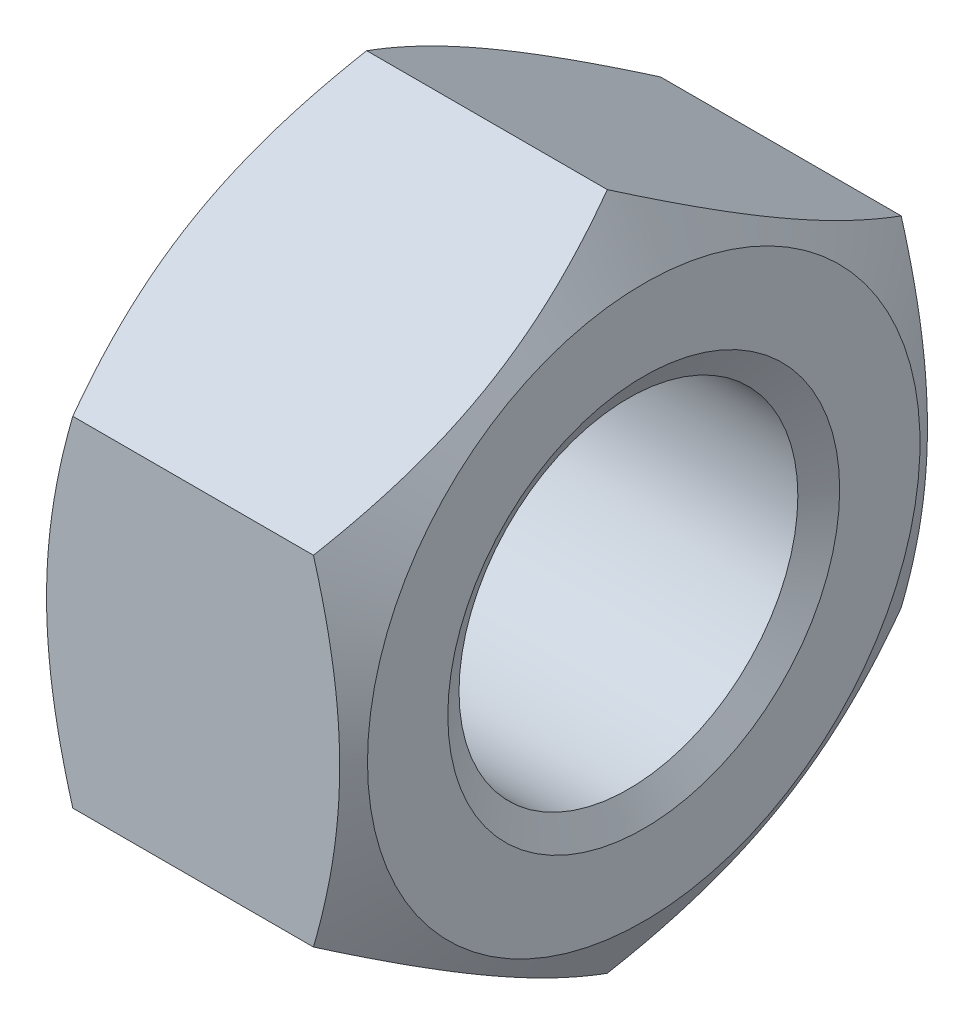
ISO-10303-21;
HEADER;
FILE_DESCRIPTION(('STEP AP214'),'2;1');
FILE_NAME('part.step','',(''),(''),'','','');
FILE_SCHEMA(('AUTOMOTIVE_DESIGN { 1 0 10303 214 1 1 1 1 }'));
ENDSEC;
DATA;
#1=APPLICATION_CONTEXT('core data for automotive mechanical design processes');
#2=APPLICATION_PROTOCOL_DEFINITION('international standard','automotive_design',2000,#1);
#3=PRODUCT_CONTEXT('',#1,'mechanical');
#4=PRODUCT('Part','Part','',(#3));
#5=PRODUCT_RELATED_PRODUCT_CATEGORY('part','',(#4));
#6=PRODUCT_DEFINITION_FORMATION('','',#4);
#7=PRODUCT_DEFINITION_CONTEXT('part definition',#1,'design');
#8=PRODUCT_DEFINITION('design','',#6,#7);
#9=PRODUCT_DEFINITION_SHAPE('','',#8);
#10=(LENGTH_UNIT() NAMED_UNIT(*) SI_UNIT(.MILLI.,.METRE.));
#11=(NAMED_UNIT(*) PLANE_ANGLE_UNIT() SI_UNIT($,.RADIAN.));
#12=(NAMED_UNIT(*) SI_UNIT($,.STERADIAN.) SOLID_ANGLE_UNIT());
#13=UNCERTAINTY_MEASURE_WITH_UNIT(LENGTH_MEASURE(1.E-05),#10,'distance_accuracy_value','');
#14=(GEOMETRIC_REPRESENTATION_CONTEXT(3) GLOBAL_UNCERTAINTY_ASSIGNED_CONTEXT((#13)) GLOBAL_UNIT_ASSIGNED_CONTEXT((#10,
#11,#12)) REPRESENTATION_CONTEXT('',''));
#15=CARTESIAN_POINT('',(0.,0.,0.));
#16=DIRECTION('',(0.,0.,1.));
#17=DIRECTION('',(1.,0.,0.));
#18=AXIS2_PLACEMENT_3D('',#15,#16,#17);
#19=CARTESIAN_POINT('',(0.,-8.66025403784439,15.));
#20=DIRECTION('',(0.,0.,1.));
#21=DIRECTION('',(1.,0.,0.));
#22=AXIS2_PLACEMENT_3D('',#19,#20,#21);
#23=PLANE('',#22);
#24=CARTESIAN_POINT('',(14.1406387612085,8.66025406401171,14.999999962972));
#25=CARTESIAN_POINT('',(14.2505268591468,8.27955805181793,14.9999999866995));
#26=CARTESIAN_POINT('',(14.3554282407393,7.89737711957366,14.9999999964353));
#27=CARTESIAN_POINT('',(14.5538714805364,7.12995063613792,15.0000000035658));
#28=CARTESIAN_POINT('',(14.6474096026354,6.74470412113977,15.0000000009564));
#29=CARTESIAN_POINT('',(14.8218689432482,5.97040202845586,14.9999999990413));
#30=CARTESIAN_POINT('',(14.9027603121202,5.58133967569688,14.9999999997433));
#31=CARTESIAN_POINT('',(15.0501891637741,4.80051152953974,15.0000000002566));
#32=CARTESIAN_POINT('',(15.1167274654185,4.40874589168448,15.000000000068));
#33=CARTESIAN_POINT('',(15.2326201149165,3.63254947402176,14.9999999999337));
#34=CARTESIAN_POINT('',(15.2823580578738,3.24817631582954,14.9999999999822));
#35=CARTESIAN_POINT('',(15.3657566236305,2.47766883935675,15.0000000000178));
#36=CARTESIAN_POINT('',(15.3994169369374,2.09153448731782,15.0000000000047));
#37=CARTESIAN_POINT('',(15.4498103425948,1.3186172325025,14.9999999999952));
#38=CARTESIAN_POINT('',(15.4665635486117,0.931835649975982,14.9999999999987));
#39=CARTESIAN_POINT('',(15.482782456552,0.157915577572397,15.0000000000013));
#40=CARTESIAN_POINT('',(15.4822486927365,-0.22922290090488,15.0000000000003));
#41=CARTESIAN_POINT('',(15.4651019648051,-0.952960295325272,14.9999999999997));
#42=CARTESIAN_POINT('',(15.450580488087,-1.28961081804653,14.9999999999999));
#43=CARTESIAN_POINT('',(15.4087390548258,-1.96213746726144,15.0000000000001));
#44=CARTESIAN_POINT('',(15.3814181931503,-2.29801353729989,15.));
#45=CARTESIAN_POINT('',(15.314454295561,-2.96880885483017,15.));
#46=CARTESIAN_POINT('',(15.2748010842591,-3.30372708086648,15.));
#47=CARTESIAN_POINT('',(15.1838681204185,-3.97199344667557,15.));
#48=CARTESIAN_POINT('',(15.1325875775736,-4.30534147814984,15.));
#49=CARTESIAN_POINT('',(14.9600087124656,-5.3172370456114,15.));
#50=CARTESIAN_POINT('',(14.8215033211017,-5.99285447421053,15.));
#51=CARTESIAN_POINT('',(14.5071537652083,-7.33401574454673,15.));
#52=CARTESIAN_POINT('',(14.3313834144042,-7.99957675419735,15.));
#53=CARTESIAN_POINT('',(14.1406388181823,-8.66025395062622,15.));
#54=B_SPLINE_CURVE_WITH_KNOTS('',3,(#24,#25,#26,#27,#28,#29,#30,#31,#32,#33,#34,#35,#36,#37,#38,
#39,#40,#41,#42,#43,#44,#45,#46,#47,#48,#49,#50,#51,#52,#53),.UNSPECIFIED.,.F.,.F.,(4,2,2,2,2,2,
2,2,2,2,2,2,2,2,4),(0.,1.18874621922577,2.37788223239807,3.56978387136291,4.76161749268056,
5.9240346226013,7.0864741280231,8.24752909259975,9.40854817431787,10.4191952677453,
11.4299138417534,12.4414685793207,13.4530920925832,15.5208227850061,17.584495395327),.UNSPECIFIED.);
#55=CARTESIAN_POINT('',(14.1406388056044,8.66025405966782,14.9999999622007));
#56=VERTEX_POINT('',#55);
#57=CARTESIAN_POINT('',(14.1406388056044,-8.66025399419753,15.));
#58=VERTEX_POINT('',#57);
#59=EDGE_CURVE('E91',#56,#58,#54,.T.);
#60=ORIENTED_EDGE('',*,*,#59,.F.);
#61=DIRECTION('',(1.,0.,0.));
#62=VECTOR('',#61,1.);
#63=CARTESIAN_POINT('',(0.,8.66025403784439,15.));
#64=LINE('',#63,#62);
#65=CARTESIAN_POINT('',(1.85936119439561,8.66025399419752,15.));
#66=VERTEX_POINT('',#65);
#67=EDGE_CURVE('E79',#66,#56,#64,.T.);
#68=ORIENTED_EDGE('',*,*,#67,.F.);
#69=CARTESIAN_POINT('',(1.85936118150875,-8.66025395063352,15.000000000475));
#70=CARTESIAN_POINT('',(1.74947309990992,-8.27955793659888,15.0000000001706));
#71=CARTESIAN_POINT('',(1.64457172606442,-7.89737700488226,15.0000000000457));
#72=CARTESIAN_POINT('',(1.44612849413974,-7.12995052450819,14.9999999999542));
#73=CARTESIAN_POINT('',(1.35259037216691,-6.74470401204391,14.9999999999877));
#74=CARTESIAN_POINT('',(1.17813103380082,-5.97040192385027,15.0000000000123));
#75=CARTESIAN_POINT('',(1.09723966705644,-5.58133957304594,15.0000000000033));
#76=CARTESIAN_POINT('',(0.949810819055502,-4.80051143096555,14.9999999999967));
#77=CARTESIAN_POINT('',(0.883272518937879,-4.4087457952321,14.9999999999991));
#78=CARTESIAN_POINT('',(0.767379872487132,-3.63254938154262,15.0000000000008));
#79=CARTESIAN_POINT('',(0.717641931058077,-3.24817622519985,15.0000000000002));
#80=CARTESIAN_POINT('',(0.634243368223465,-2.4776687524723,14.9999999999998));
#81=CARTESIAN_POINT('',(0.600583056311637,-2.09153440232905,14.9999999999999));
#82=CARTESIAN_POINT('',(0.550189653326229,-1.31861715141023,15.0000000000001));
#83=CARTESIAN_POINT('',(0.533436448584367,-0.931835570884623,15.));
#84=CARTESIAN_POINT('',(0.517217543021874,-0.157915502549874,15.));
#85=CARTESIAN_POINT('',(0.517751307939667,0.229222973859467,15.));
#86=CARTESIAN_POINT('',(0.534898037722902,0.952960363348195,15.));
#87=CARTESIAN_POINT('',(0.549419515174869,1.28961088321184,15.));
#88=CARTESIAN_POINT('',(0.591260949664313,1.96213752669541,15.));
#89=CARTESIAN_POINT('',(0.618581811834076,2.29801359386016,15.));
#90=CARTESIAN_POINT('',(0.685545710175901,2.96880890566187,15.));
#91=CARTESIAN_POINT('',(0.725198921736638,3.30372712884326,15.));
#92=CARTESIAN_POINT('',(0.816131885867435,3.97199348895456,15.));
#93=CARTESIAN_POINT('',(0.867412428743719,4.30534151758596,15.));
#94=CARTESIAN_POINT('',(1.03999129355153,5.31723707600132,15.));
#95=CARTESIAN_POINT('',(1.17849668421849,5.99285449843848,15.));
#96=CARTESIAN_POINT('',(1.49284623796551,7.33401575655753,15.));
#97=CARTESIAN_POINT('',(1.66861658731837,7.99957676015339,15.));
#98=CARTESIAN_POINT('',(1.85936118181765,8.66025395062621,15.));
#99=B_SPLINE_CURVE_WITH_KNOTS('',3,(#69,#70,#71,#72,#73,#74,#75,#76,#77,#78,#79,#80,#81,#82,#83,
#84,#85,#86,#87,#88,#89,#90,#91,#92,#93,#94,#95,#96,#97,#98),.UNSPECIFIED.,.F.,.F.,(4,2,2,2,2,2,
2,2,2,2,2,2,2,2,4),(0.,1.18874621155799,2.37788221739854,3.56978384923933,4.76161746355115,
5.92403458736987,7.08647408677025,8.24752904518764,9.40854812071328,10.4191952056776,
11.4299137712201,12.4414685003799,13.453092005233,15.5208226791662,17.5844952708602),.UNSPECIFIED.);
#100=CARTESIAN_POINT('',(1.8593612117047,-8.66025402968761,15.000000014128));
#101=VERTEX_POINT('',#100);
#102=EDGE_CURVE('E115',#101,#66,#99,.T.);
#103=ORIENTED_EDGE('',*,*,#102,.F.);
#104=DIRECTION('',(1.,0.,0.));
#105=VECTOR('',#104,1.);
#106=CARTESIAN_POINT('',(0.,-8.66025403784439,15.));
#107=LINE('',#106,#105);
#108=EDGE_CURVE('E94',#58,#101,#107,.F.);
#109=ORIENTED_EDGE('',*,*,#108,.F.);
#110=EDGE_LOOP('',(#60,#68,#103,#109));
#111=FACE_BOUND('',#110,.T.);
#112=ADVANCED_FACE('F15',(#111),#23,.T.);
#113=CARTESIAN_POINT('',(0.,8.66025403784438,15.));
#114=DIRECTION('',(0.,0.866025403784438,0.5));
#115=DIRECTION('',(0.,-0.5,0.866025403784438));
#116=AXIS2_PLACEMENT_3D('',#113,#114,#115);
#117=PLANE('',#116);
#118=CARTESIAN_POINT('',(14.1406388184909,17.3205080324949,7.57635507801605E-08));
#119=CARTESIAN_POINT('',(14.2505269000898,17.1301600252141,0.32969249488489));
#120=CARTESIAN_POINT('',(14.3554282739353,16.9390695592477,0.66067089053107));
#121=CARTESIAN_POINT('',(14.5538715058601,16.5553563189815,1.3252817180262));
#122=CARTESIAN_POINT('',(14.6474096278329,16.3627330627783,1.65891498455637));
#123=CARTESIAN_POINT('',(14.821868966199,15.9755820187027,2.32948026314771));
#124=CARTESIAN_POINT('',(14.9027603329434,15.7810508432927,2.66641814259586));
#125=CARTESIAN_POINT('',(15.0501891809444,15.3906367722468,3.34263514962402));
#126=CARTESIAN_POINT('',(15.116727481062,15.1947539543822,3.68191414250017));
#127=CARTESIAN_POINT('',(15.2326201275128,14.8066557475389,4.35411995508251));
#128=CARTESIAN_POINT('',(15.2823580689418,14.614469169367,4.68699687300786));
#129=CARTESIAN_POINT('',(15.3657566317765,14.2292154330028,5.35427591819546));
#130=CARTESIAN_POINT('',(15.3994169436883,14.0361482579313,5.68867807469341));
#131=CARTESIAN_POINT('',(15.4498103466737,13.649689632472,6.35804404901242));
#132=CARTESIAN_POINT('',(15.4665635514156,13.4562988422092,6.69300672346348));
#133=CARTESIAN_POINT('',(15.4827824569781,13.0693388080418,7.36324116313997));
#134=CARTESIAN_POINT('',(15.4822486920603,12.8757695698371,7.69851291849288));
#135=CARTESIAN_POINT('',(15.4651019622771,12.5139008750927,8.32528788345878));
#136=CARTESIAN_POINT('',(15.4505804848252,12.3455756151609,8.61683578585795));
#137=CARTESIAN_POINT('',(15.4087390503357,12.0093122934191,9.19926094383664));
#138=CARTESIAN_POINT('',(15.381418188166,11.8413742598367,9.49013815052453));
#139=CARTESIAN_POINT('',(15.3144542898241,11.5059766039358,10.0710639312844));
#140=CARTESIAN_POINT('',(15.2748010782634,11.3385174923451,10.3611116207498));
#141=CARTESIAN_POINT('',(15.1838681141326,11.0043843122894,10.9398472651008));
#142=CARTESIAN_POINT('',(15.1325875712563,10.8377102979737,11.2285351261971));
#143=CARTESIAN_POINT('',(14.9600087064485,10.331762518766,12.1048623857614));
#144=CARTESIAN_POINT('',(14.8215033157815,9.99395380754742,12.6899642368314));
#145=CARTESIAN_POINT('',(14.5071537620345,9.32337317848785,13.8514439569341));
#146=CARTESIAN_POINT('',(14.3313834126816,8.9905926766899,14.4278366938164));
#147=CARTESIAN_POINT('',(14.1406388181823,8.66025408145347,14.9999999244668));
#148=B_SPLINE_CURVE_WITH_KNOTS('',3,(#118,#119,#120,#121,#122,#123,#124,#125,#126,#127,#128,
#129,#130,#131,#132,#133,#134,#135,#136,#137,#138,#139,#140,#141,#142,#143,#144,#145,#146,#147),
.UNSPECIFIED.,.F.,.F.,(4,2,2,2,2,2,2,2,2,2,2,2,2,2,4),(0.,1.18874621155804,2.37788221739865,
3.56978384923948,4.76161746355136,5.92403458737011,7.08647408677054,8.24752904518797,
9.40854812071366,10.419195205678,11.4299137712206,12.4414685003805,13.4530920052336,
15.5208226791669,17.584495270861),.UNSPECIFIED.);
#149=CARTESIAN_POINT('',(14.1406387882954,17.3205080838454,1.41276080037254E-08));
#150=VERTEX_POINT('',#149);
#151=EDGE_CURVE('E19',#150,#56,#148,.T.);
#152=ORIENTED_EDGE('',*,*,#151,.F.);
#153=DIRECTION('',(1.,0.,0.));
#154=VECTOR('',#153,1.);
#155=CARTESIAN_POINT('',(0.,17.3205080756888,0.));
#156=LINE('',#155,#154);
#157=CARTESIAN_POINT('',(1.85936119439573,17.3205080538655,3.77989384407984E-08));
#158=VERTEX_POINT('',#157);
#159=EDGE_CURVE('E72',#158,#150,#156,.T.);
#160=ORIENTED_EDGE('',*,*,#159,.F.);
#161=CARTESIAN_POINT('',(1.85936123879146,8.66025399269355,15.0000000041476));
#162=CARTESIAN_POINT('',(1.74947314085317,8.85060201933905,14.6703075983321));
#163=CARTESIAN_POINT('',(1.64457175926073,9.04169249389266,14.3393292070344));
#164=CARTESIAN_POINT('',(1.44612851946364,9.42540574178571,13.6747183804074));
#165=CARTESIAN_POINT('',(1.3525903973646,9.61802899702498,13.3410851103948));
#166=CARTESIAN_POINT('',(1.1781310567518,10.0051800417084,12.6705198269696));
#167=CARTESIAN_POINT('',(1.09723968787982,10.1997112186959,12.3335819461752));
#168=CARTESIAN_POINT('',(0.949810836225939,10.590125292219,11.6573649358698));
#169=CARTESIAN_POINT('',(0.883272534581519,10.7860081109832,11.318085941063));
#170=CARTESIAN_POINT('',(0.767379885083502,11.1741063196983,10.6458801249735));
#171=CARTESIAN_POINT('',(0.717641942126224,11.3662928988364,10.3130032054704));
#172=CARTESIAN_POINT('',(0.634243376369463,11.7515466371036,9.64572415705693));
#173=CARTESIAN_POINT('',(0.600583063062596,11.9446138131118,9.31132199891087));
#174=CARTESIAN_POINT('',(0.550189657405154,12.3310724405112,8.64195602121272));
#175=CARTESIAN_POINT('',(0.53343645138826,12.5244632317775,8.30699334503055));
#176=CARTESIAN_POINT('',(0.51721754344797,12.9114232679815,7.63675890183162));
#177=CARTESIAN_POINT('',(0.517751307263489,13.1049925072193,7.30148714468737));
#178=CARTESIAN_POINT('',(0.534898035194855,13.466861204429,6.67471217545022));
#179=CARTESIAN_POINT('',(0.549419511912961,13.6351864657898,6.38316427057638));
#180=CARTESIAN_POINT('',(0.591260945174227,13.9714497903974,5.80073910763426));
#181=CARTESIAN_POINT('',(0.61858180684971,14.1393878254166,5.50986189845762));
#182=CARTESIAN_POINT('',(0.685545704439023,14.4747854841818,4.92893611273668));
#183=CARTESIAN_POINT('',(0.725198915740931,14.6422445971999,4.63888842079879));
#184=CARTESIAN_POINT('',(0.816131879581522,14.9763777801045,4.06015277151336));
#185=CARTESIAN_POINT('',(0.867412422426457,15.1430517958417,3.77146490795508));
#186=CARTESIAN_POINT('',(1.03999128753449,15.6489995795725,2.89513764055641));
#187=CARTESIAN_POINT('',(1.1784966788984,15.9868082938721,2.31003578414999));
#188=CARTESIAN_POINT('',(1.49284623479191,16.6573889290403,1.14855605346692));
#189=CARTESIAN_POINT('',(1.66861658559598,16.9901694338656,0.572163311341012));
#190=CARTESIAN_POINT('',(1.85936118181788,17.3205080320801,7.55324771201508E-08));
#191=B_SPLINE_CURVE_WITH_KNOTS('',3,(#161,#162,#163,#164,#165,#166,#167,#168,#169,#170,#171,
#172,#173,#174,#175,#176,#177,#178,#179,#180,#181,#182,#183,#184,#185,#186,#187,#188,#189,#190),
.UNSPECIFIED.,.F.,.F.,(4,2,2,2,2,2,2,2,2,2,2,2,2,2,4),(0.,1.18874621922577,2.37788223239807,
3.56978387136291,4.76161749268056,5.9240346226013,7.0864741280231,8.24752909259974,
9.40854817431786,10.4191952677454,11.4299138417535,12.441468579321,13.4530920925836,
15.5208227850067,17.5844953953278),.UNSPECIFIED.);
#192=EDGE_CURVE('E82',#66,#158,#191,.T.);
#193=ORIENTED_EDGE('',*,*,#192,.F.);
#194=ORIENTED_EDGE('',*,*,#67,.T.);
#195=EDGE_LOOP('',(#152,#160,#193,#194));
#196=FACE_BOUND('',#195,.T.);
#197=ADVANCED_FACE('F81',(#196),#117,.T.);
#198=CARTESIAN_POINT('',(0.,17.3205080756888,0.));
#199=DIRECTION('',(0.,0.866025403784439,-0.499999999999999));
#200=DIRECTION('',(0.,0.499999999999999,0.866025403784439));
#201=AXIS2_PLACEMENT_3D('',#198,#199,#200);
#202=PLANE('',#201);
#203=CARTESIAN_POINT('',(14.1406387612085,8.66025399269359,-15.0000000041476));
#204=CARTESIAN_POINT('',(14.2505268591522,8.85060201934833,-14.6703075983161));
#205=CARTESIAN_POINT('',(14.3554282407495,9.04169249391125,-14.3393292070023));
#206=CARTESIAN_POINT('',(14.5538714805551,9.42540574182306,-13.6747183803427));
#207=CARTESIAN_POINT('',(14.6474096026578,9.61802899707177,-13.3410851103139));
#208=CARTESIAN_POINT('',(14.8218689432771,10.0051800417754,-12.6705198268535));
#209=CARTESIAN_POINT('',(14.9027603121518,10.1997112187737,-12.3335819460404));
#210=CARTESIAN_POINT('',(15.0501891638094,10.5901252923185,-11.6573649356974));
#211=CARTESIAN_POINT('',(15.1167274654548,10.7860081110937,-11.3180859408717));
#212=CARTESIAN_POINT('',(15.2326201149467,11.1741063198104,-10.6458801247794));
#213=CARTESIAN_POINT('',(15.2823580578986,11.366292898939,-10.3130032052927));
#214=CARTESIAN_POINT('',(15.365756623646,11.751546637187,-9.64572415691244));
#215=CARTESIAN_POINT('',(15.3994169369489,11.9446138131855,-9.31132199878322));
#216=CARTESIAN_POINT('',(15.4498103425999,12.3310724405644,-8.64195602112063));
#217=CARTESIAN_POINT('',(15.4665635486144,12.5244632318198,-8.30699334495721));
#218=CARTESIAN_POINT('',(15.482782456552,12.9114232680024,-7.63675890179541));
#219=CARTESIAN_POINT('',(15.4822486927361,13.1049925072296,-7.30148714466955));
#220=CARTESIAN_POINT('',(15.465101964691,13.466861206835,-6.67471217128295));
#221=CARTESIAN_POINT('',(15.4505804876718,13.6351864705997,-6.38316426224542));
#222=CARTESIAN_POINT('',(15.4087390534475,13.9714498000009,-5.80073909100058));
#223=CARTESIAN_POINT('',(15.3814181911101,14.1393878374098,-5.50986187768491));
#224=CARTESIAN_POINT('',(15.3144542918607,14.4747855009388,-4.9289360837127));
#225=CARTESIAN_POINT('',(15.2748010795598,14.6422446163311,-4.63888838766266));
#226=CARTESIAN_POINT('',(15.1838681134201,14.976377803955,-4.06015273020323));
#227=CARTESIAN_POINT('',(15.1325875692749,15.1430518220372,-3.77146486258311));
#228=CARTESIAN_POINT('',(14.9600086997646,15.6489996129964,-2.89513758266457));
#229=CARTESIAN_POINT('',(14.8215033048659,15.9868083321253,-2.31003571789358));
#230=CARTESIAN_POINT('',(14.5071537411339,16.6573889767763,-1.14855597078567));
#231=CARTESIAN_POINT('',(14.331383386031,16.9901694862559,-0.572163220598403));
#232=CARTESIAN_POINT('',(14.1406387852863,17.3205080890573,2.31549808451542E-08));
#233=B_SPLINE_CURVE_WITH_KNOTS('',3,(#203,#204,#205,#206,#207,#208,#209,#210,#211,#212,#213,
#214,#215,#216,#217,#218,#219,#220,#221,#222,#223,#224,#225,#226,#227,#228,#229,#230,#231,#232),
.UNSPECIFIED.,.F.,.F.,(4,2,2,2,2,2,2,2,2,2,2,2,2,2,4),(0.,1.18874621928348,2.3778822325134,
3.56978387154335,4.76161749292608,5.92403462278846,7.08647412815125,8.24752909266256,
9.40854817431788,10.4191952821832,11.4299138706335,12.441468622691,13.4530921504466,
15.5208228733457,17.5844955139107),.UNSPECIFIED.);
#234=CARTESIAN_POINT('',(14.1406388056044,8.66025399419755,-15.));
#235=VERTEX_POINT('',#234);
#236=EDGE_CURVE('E93',#235,#150,#233,.T.);
#237=ORIENTED_EDGE('',*,*,#236,.F.);
#238=DIRECTION('',(-1.,0.,0.));
#239=VECTOR('',#238,1.);
#240=CARTESIAN_POINT('',(0.,8.66025403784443,-15.));
#241=LINE('',#240,#239);
#242=CARTESIAN_POINT('',(1.85936119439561,8.66025405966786,-14.9999999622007));
#243=VERTEX_POINT('',#242);
#244=EDGE_CURVE('E188',#243,#235,#241,.F.);
#245=ORIENTED_EDGE('',*,*,#244,.F.);
#246=CARTESIAN_POINT('',(1.85936123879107,17.3205080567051,4.1174744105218E-08));
#247=CARTESIAN_POINT('',(1.7494731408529,17.1301600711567,-0.32969238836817));
#248=CARTESIAN_POINT('',(1.6445717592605,16.9390696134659,-0.660670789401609));
#249=CARTESIAN_POINT('',(1.44612851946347,16.5553563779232,-1.32528162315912));
#250=CARTESIAN_POINT('',(1.35259039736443,16.3627331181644,-1.65891489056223));
#251=CARTESIAN_POINT('',(1.17813105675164,15.9755820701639,-2.32948017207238));
#252=CARTESIAN_POINT('',(1.09723968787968,15.7810508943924,-2.6664180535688));
#253=CARTESIAN_POINT('',(0.949810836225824,15.3906368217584,-3.34263506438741));
#254=CARTESIAN_POINT('',(0.883272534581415,15.1947540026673,-3.68191405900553));
#255=CARTESIAN_POINT('',(0.76737988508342,14.8066557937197,-4.35411987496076));
#256=CARTESIAN_POINT('',(0.717641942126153,14.6144692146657,-4.68699679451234));
#257=CARTESIAN_POINT('',(0.634243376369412,14.22921547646,-5.35427584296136));
#258=CARTESIAN_POINT('',(0.600583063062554,14.0361483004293,-5.68867800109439));
#259=CARTESIAN_POINT('',(0.550189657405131,13.6496896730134,-6.35804397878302));
#260=CARTESIAN_POINT('',(0.533436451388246,13.4562988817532,-6.69300665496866));
#261=CARTESIAN_POINT('',(0.517217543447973,13.0693388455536,-7.3632410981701));
#262=CARTESIAN_POINT('',(0.5177513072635,12.8757696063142,-7.69851285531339));
#263=CARTESIAN_POINT('',(0.534898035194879,12.5139009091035,-8.32528782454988));
#264=CARTESIAN_POINT('',(0.549419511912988,12.345575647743,-8.61683572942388));
#265=CARTESIAN_POINT('',(0.591260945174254,12.0093123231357,-9.19926089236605));
#266=CARTESIAN_POINT('',(0.618581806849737,11.8413742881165,-9.49013810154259));
#267=CARTESIAN_POINT('',(0.685545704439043,11.5059766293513,-10.0710638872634));
#268=CARTESIAN_POINT('',(0.725198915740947,11.3385175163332,-10.3611115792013));
#269=CARTESIAN_POINT('',(0.816131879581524,11.0043843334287,-10.9398472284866));
#270=CARTESIAN_POINT('',(0.86741242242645,10.8377103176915,-11.2285350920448));
#271=CARTESIAN_POINT('',(1.03999128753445,10.3317625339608,-12.1048623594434));
#272=CARTESIAN_POINT('',(1.17849667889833,9.99395381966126,-12.6899642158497));
#273=CARTESIAN_POINT('',(1.49284623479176,9.32337318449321,-13.8514439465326));
#274=CARTESIAN_POINT('',(1.6686165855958,8.99059267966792,-14.4278366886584));
#275=CARTESIAN_POINT('',(1.85936118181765,8.66025408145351,-14.9999999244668));
#276=B_SPLINE_CURVE_WITH_KNOTS('',3,(#246,#247,#248,#249,#250,#251,#252,#253,#254,#255,#256,
#257,#258,#259,#260,#261,#262,#263,#264,#265,#266,#267,#268,#269,#270,#271,#272,#273,#274,#275),
.UNSPECIFIED.,.F.,.F.,(4,2,2,2,2,2,2,2,2,2,2,2,2,2,4),(0.,1.18874621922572,2.37788223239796,
3.56978387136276,4.76161749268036,5.92403462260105,7.08647412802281,8.24752909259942,
9.4085481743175,10.4191952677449,11.4299138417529,12.4414685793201,13.4530920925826,
15.5208227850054,17.5844953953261),.UNSPECIFIED.);
#277=EDGE_CURVE('E158',#158,#243,#276,.T.);
#278=ORIENTED_EDGE('',*,*,#277,.F.);
#279=ORIENTED_EDGE('',*,*,#159,.T.);
#280=EDGE_LOOP('',(#237,#245,#278,#279));
#281=FACE_BOUND('',#280,.T.);
#282=ADVANCED_FACE('F162',(#281),#202,.T.);
#283=CARTESIAN_POINT('',(0.,8.66025403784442,-15.));
#284=DIRECTION('',(0.,0.,-1.));
#285=DIRECTION('',(-1.,0.,0.));
#286=AXIS2_PLACEMENT_3D('',#283,#284,#285);
#287=PLANE('',#286);
#288=CARTESIAN_POINT('',(14.1406387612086,-8.66025406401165,-14.999999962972));
#289=CARTESIAN_POINT('',(14.2505268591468,-8.27955805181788,-14.9999999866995));
#290=CARTESIAN_POINT('',(14.3554282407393,-7.8973771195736,-14.9999999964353));
#291=CARTESIAN_POINT('',(14.5538714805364,-7.12995063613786,-15.0000000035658));
#292=CARTESIAN_POINT('',(14.6474096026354,-6.74470412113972,-15.0000000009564));
#293=CARTESIAN_POINT('',(14.8218689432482,-5.97040202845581,-14.9999999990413));
#294=CARTESIAN_POINT('',(14.9027603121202,-5.58133967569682,-14.9999999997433));
#295=CARTESIAN_POINT('',(15.0501891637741,-4.80051152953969,-15.0000000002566));
#296=CARTESIAN_POINT('',(15.1167274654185,-4.40874589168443,-15.000000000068));
#297=CARTESIAN_POINT('',(15.2326201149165,-3.63254947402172,-14.9999999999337));
#298=CARTESIAN_POINT('',(15.2823580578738,-3.24817631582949,-14.9999999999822));
#299=CARTESIAN_POINT('',(15.3657566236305,-2.4776688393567,-15.0000000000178));
#300=CARTESIAN_POINT('',(15.3994169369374,-2.09153448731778,-15.0000000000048));
#301=CARTESIAN_POINT('',(15.4498103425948,-1.31861723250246,-14.9999999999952));
#302=CARTESIAN_POINT('',(15.4665635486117,-0.931835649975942,-14.9999999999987));
#303=CARTESIAN_POINT('',(15.482782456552,-0.157915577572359,-15.0000000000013));
#304=CARTESIAN_POINT('',(15.4822486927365,0.229222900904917,-15.0000000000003));
#305=CARTESIAN_POINT('',(15.4651019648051,0.952960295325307,-14.9999999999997));
#306=CARTESIAN_POINT('',(15.450580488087,1.28961081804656,-14.9999999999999));
#307=CARTESIAN_POINT('',(15.4087390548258,1.96213746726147,-15.0000000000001));
#308=CARTESIAN_POINT('',(15.3814181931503,2.29801353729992,-15.));
#309=CARTESIAN_POINT('',(15.314454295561,2.9688088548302,-15.));
#310=CARTESIAN_POINT('',(15.2748010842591,3.30372708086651,-15.));
#311=CARTESIAN_POINT('',(15.1838681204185,3.9719934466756,-15.));
#312=CARTESIAN_POINT('',(15.1325875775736,4.30534147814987,-15.));
#313=CARTESIAN_POINT('',(14.9600087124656,5.31723704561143,-15.));
#314=CARTESIAN_POINT('',(14.8215033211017,5.99285447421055,-15.));
#315=CARTESIAN_POINT('',(14.5071537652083,7.33401574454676,-15.));
#316=CARTESIAN_POINT('',(14.3313834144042,7.99957675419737,-15.));
#317=CARTESIAN_POINT('',(14.1406388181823,8.66025395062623,-15.));
#318=B_SPLINE_CURVE_WITH_KNOTS('',3,(#288,#289,#290,#291,#292,#293,#294,#295,#296,#297,#298,
#299,#300,#301,#302,#303,#304,#305,#306,#307,#308,#309,#310,#311,#312,#313,#314,#315,#316,#317),
.UNSPECIFIED.,.F.,.F.,(4,2,2,2,2,2,2,2,2,2,2,2,2,2,4),(0.,1.18874621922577,2.37788223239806,
3.5697838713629,4.76161749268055,5.92403462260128,7.08647412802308,8.24752909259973,
9.40854817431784,10.4191952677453,11.4299138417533,12.4414685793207,13.4530920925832,
15.5208227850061,17.584495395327),.UNSPECIFIED.);
#319=CARTESIAN_POINT('',(14.1406388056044,-8.66025405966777,-14.9999999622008));
#320=VERTEX_POINT('',#319);
#321=EDGE_CURVE('E173',#320,#235,#318,.T.);
#322=ORIENTED_EDGE('',*,*,#321,.F.);
#323=DIRECTION('',(1.,0.,0.));
#324=VECTOR('',#323,1.);
#325=CARTESIAN_POINT('',(0.,-8.66025403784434,-15.0000000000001));
#326=LINE('',#325,#324);
#327=CARTESIAN_POINT('',(1.85936119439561,-8.66025399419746,-15.));
#328=VERTEX_POINT('',#327);
#329=EDGE_CURVE('E186',#328,#320,#326,.T.);
#330=ORIENTED_EDGE('',*,*,#329,.F.);
#331=CARTESIAN_POINT('',(1.85936123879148,8.66025406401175,-14.999999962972));
#332=CARTESIAN_POINT('',(1.74947314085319,8.27955805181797,-14.9999999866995));
#333=CARTESIAN_POINT('',(1.64457175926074,7.89737711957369,-14.9999999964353));
#334=CARTESIAN_POINT('',(1.44612851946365,7.12995063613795,-15.0000000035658));
#335=CARTESIAN_POINT('',(1.35259039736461,6.74470412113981,-15.0000000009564));
#336=CARTESIAN_POINT('',(1.17813105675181,5.9704020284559,-14.9999999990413));
#337=CARTESIAN_POINT('',(1.09723968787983,5.58133967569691,-14.9999999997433));
#338=CARTESIAN_POINT('',(0.949810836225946,4.80051152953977,-15.0000000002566));
#339=CARTESIAN_POINT('',(0.883272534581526,4.40874589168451,-15.000000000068));
#340=CARTESIAN_POINT('',(0.767379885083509,3.63254947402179,-14.9999999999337));
#341=CARTESIAN_POINT('',(0.717641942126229,3.24817631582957,-14.9999999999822));
#342=CARTESIAN_POINT('',(0.634243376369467,2.47766883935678,-15.0000000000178));
#343=CARTESIAN_POINT('',(0.600583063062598,2.09153448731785,-15.0000000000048));
#344=CARTESIAN_POINT('',(0.550189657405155,1.31861723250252,-14.9999999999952));
#345=CARTESIAN_POINT('',(0.533436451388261,0.931835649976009,-14.9999999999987));
#346=CARTESIAN_POINT('',(0.517217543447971,0.157915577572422,-15.0000000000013));
#347=CARTESIAN_POINT('',(0.517751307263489,-0.229222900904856,-15.0000000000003));
#348=CARTESIAN_POINT('',(0.534898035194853,-0.952960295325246,-14.9999999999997));
#349=CARTESIAN_POINT('',(0.549419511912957,-1.2896108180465,-14.9999999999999));
#350=CARTESIAN_POINT('',(0.591260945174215,-1.96213746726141,-15.0000000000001));
#351=CARTESIAN_POINT('',(0.618581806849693,-2.29801353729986,-15.));
#352=CARTESIAN_POINT('',(0.685545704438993,-2.96880885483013,-15.));
#353=CARTESIAN_POINT('',(0.725198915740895,-3.30372708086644,-15.));
#354=CARTESIAN_POINT('',(0.816131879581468,-3.97199344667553,-15.));
#355=CARTESIAN_POINT('',(0.867412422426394,-4.3053414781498,-15.));
#356=CARTESIAN_POINT('',(1.0399912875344,-5.31723704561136,-15.));
#357=CARTESIAN_POINT('',(1.17849667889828,-5.99285447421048,-15.));
#358=CARTESIAN_POINT('',(1.49284623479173,-7.33401574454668,-15.));
#359=CARTESIAN_POINT('',(1.66861658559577,-7.99957675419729,-15.));
#360=CARTESIAN_POINT('',(1.85936118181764,-8.66025395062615,-15.));
#361=B_SPLINE_CURVE_WITH_KNOTS('',3,(#331,#332,#333,#334,#335,#336,#337,#338,#339,#340,#341,
#342,#343,#344,#345,#346,#347,#348,#349,#350,#351,#352,#353,#354,#355,#356,#357,#358,#359,#360),
.UNSPECIFIED.,.F.,.F.,(4,2,2,2,2,2,2,2,2,2,2,2,2,2,4),(0.,1.18874621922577,2.37788223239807,
3.56978387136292,4.76161749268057,5.92403462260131,7.08647412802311,8.24752909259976,
9.40854817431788,10.4191952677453,11.4299138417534,12.4414685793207,13.4530920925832,
15.5208227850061,17.584495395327),.UNSPECIFIED.);
#362=EDGE_CURVE('E153',#243,#328,#361,.T.);
#363=ORIENTED_EDGE('',*,*,#362,.F.);
#364=ORIENTED_EDGE('',*,*,#244,.T.);
#365=EDGE_LOOP('',(#322,#330,#363,#364));
#366=FACE_BOUND('',#365,.T.);
#367=ADVANCED_FACE('F165',(#366),#287,.T.);
#368=CARTESIAN_POINT('',(0.,-8.66025403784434,-15.));
#369=DIRECTION('',(0.,-0.866025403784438,-0.500000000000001));
#370=DIRECTION('',(0.,0.500000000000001,-0.866025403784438));
#371=AXIS2_PLACEMENT_3D('',#368,#369,#370);
#372=PLANE('',#371);
#373=CARTESIAN_POINT('',(14.1406387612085,-17.3205080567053,4.11755473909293E-08));
#374=CARTESIAN_POINT('',(14.2505268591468,-17.130160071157,-0.329692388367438));
#375=CARTESIAN_POINT('',(14.3554282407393,-16.9390696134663,-0.660670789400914));
#376=CARTESIAN_POINT('',(14.5538714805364,-16.5553563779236,-1.32528162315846));
#377=CARTESIAN_POINT('',(14.6474096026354,-16.3627331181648,-1.65891489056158));
#378=CARTESIAN_POINT('',(14.8218689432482,-15.9755820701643,-2.32948017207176));
#379=CARTESIAN_POINT('',(14.9027603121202,-15.7810508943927,-2.66641805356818));
#380=CARTESIAN_POINT('',(15.0501891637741,-15.3906368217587,-3.34263506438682));
#381=CARTESIAN_POINT('',(15.1167274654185,-15.1947540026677,-3.68191405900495));
#382=CARTESIAN_POINT('',(15.2326201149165,-14.8066557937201,-4.35411987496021));
#383=CARTESIAN_POINT('',(15.2823580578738,-14.614469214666,-4.6869967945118));
#384=CARTESIAN_POINT('',(15.3657566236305,-14.2292154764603,-5.35427584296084));
#385=CARTESIAN_POINT('',(15.3994169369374,-14.0361483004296,-5.68867800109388));
#386=CARTESIAN_POINT('',(15.4498103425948,-13.6496896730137,-6.35804397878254));
#387=CARTESIAN_POINT('',(15.4665635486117,-13.4562988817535,-6.69300665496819));
#388=CARTESIAN_POINT('',(15.482782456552,-13.0693388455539,-7.36324109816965));
#389=CARTESIAN_POINT('',(15.4822486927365,-12.8757696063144,-7.69851285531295));
#390=CARTESIAN_POINT('',(15.4651019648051,-12.5139009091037,-8.32528782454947));
#391=CARTESIAN_POINT('',(15.450580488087,-12.3455756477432,-8.61683572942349));
#392=CARTESIAN_POINT('',(15.4087390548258,-12.0093123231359,-9.19926089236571));
#393=CARTESIAN_POINT('',(15.3814181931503,-11.8413742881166,-9.49013810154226));
#394=CARTESIAN_POINT('',(15.314454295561,-11.5059766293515,-10.0710638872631));
#395=CARTESIAN_POINT('',(15.2748010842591,-11.3385175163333,-10.361111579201));
#396=CARTESIAN_POINT('',(15.1838681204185,-11.0043843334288,-10.9398472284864));
#397=CARTESIAN_POINT('',(15.1325875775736,-10.8377103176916,-11.2285350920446));
#398=CARTESIAN_POINT('',(14.9600087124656,-10.3317625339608,-12.1048623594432));
#399=CARTESIAN_POINT('',(14.8215033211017,-9.99395381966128,-12.6899642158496));
#400=CARTESIAN_POINT('',(14.5071537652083,-9.32337318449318,-13.8514439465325));
#401=CARTESIAN_POINT('',(14.3313834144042,-8.99059267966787,-14.4278366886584));
#402=CARTESIAN_POINT('',(14.1406388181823,-8.66025408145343,-14.9999999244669));
#403=B_SPLINE_CURVE_WITH_KNOTS('',3,(#373,#374,#375,#376,#377,#378,#379,#380,#381,#382,#383,
#384,#385,#386,#387,#388,#389,#390,#391,#392,#393,#394,#395,#396,#397,#398,#399,#400,#401,#402),
.UNSPECIFIED.,.F.,.F.,(4,2,2,2,2,2,2,2,2,2,2,2,2,2,4),(0.,1.18874621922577,2.37788223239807,
3.56978387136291,4.76161749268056,5.9240346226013,7.0864741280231,8.24752909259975,
9.40854817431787,10.4191952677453,11.4299138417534,12.4414685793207,13.4530920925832,
15.5208227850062,17.584495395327),.UNSPECIFIED.);
#404=CARTESIAN_POINT('',(14.1406388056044,-17.3205080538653,3.77992944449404E-08));
#405=VERTEX_POINT('',#404);
#406=EDGE_CURVE('E97',#405,#320,#403,.T.);
#407=ORIENTED_EDGE('',*,*,#406,.F.);
#408=DIRECTION('',(1.,0.,0.));
#409=VECTOR('',#408,1.);
#410=CARTESIAN_POINT('',(0.,-17.3205080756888,0.));
#411=LINE('',#410,#409);
#412=CARTESIAN_POINT('',(1.85936119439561,-17.3205080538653,-3.77993073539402E-08));
#413=VERTEX_POINT('',#412);
#414=EDGE_CURVE('E190',#413,#405,#411,.T.);
#415=ORIENTED_EDGE('',*,*,#414,.F.);
#416=CARTESIAN_POINT('',(1.85936123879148,-8.66025399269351,-15.0000000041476));
#417=CARTESIAN_POINT('',(1.74947314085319,-8.85060201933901,-14.6703075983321));
#418=CARTESIAN_POINT('',(1.64457175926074,-9.04169249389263,-14.3393292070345));
#419=CARTESIAN_POINT('',(1.44612851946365,-9.42540574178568,-13.6747183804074));
#420=CARTESIAN_POINT('',(1.35259039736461,-9.61802899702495,-13.3410851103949));
#421=CARTESIAN_POINT('',(1.17813105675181,-10.0051800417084,-12.6705198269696));
#422=CARTESIAN_POINT('',(1.09723968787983,-10.1997112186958,-12.3335819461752));
#423=CARTESIAN_POINT('',(0.949810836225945,-10.5901252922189,-11.6573649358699));
#424=CARTESIAN_POINT('',(0.883272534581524,-10.7860081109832,-11.3180859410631));
#425=CARTESIAN_POINT('',(0.767379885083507,-11.1741063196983,-10.6458801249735));
#426=CARTESIAN_POINT('',(0.717641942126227,-11.3662928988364,-10.3130032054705));
#427=CARTESIAN_POINT('',(0.634243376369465,-11.7515466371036,-9.64572415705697));
#428=CARTESIAN_POINT('',(0.600583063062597,-11.9446138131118,-9.31132199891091));
#429=CARTESIAN_POINT('',(0.550189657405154,-12.3310724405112,-8.64195602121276));
#430=CARTESIAN_POINT('',(0.533436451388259,-12.5244632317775,-8.30699334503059));
#431=CARTESIAN_POINT('',(0.517217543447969,-12.9114232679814,-7.63675890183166));
#432=CARTESIAN_POINT('',(0.517751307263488,-13.1049925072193,-7.30148714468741));
#433=CARTESIAN_POINT('',(0.534898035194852,-13.4668612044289,-6.67471217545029));
#434=CARTESIAN_POINT('',(0.549419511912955,-13.6351864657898,-6.38316427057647));
#435=CARTESIAN_POINT('',(0.591260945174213,-13.9714497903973,-5.80073910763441));
#436=CARTESIAN_POINT('',(0.618581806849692,-14.1393878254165,-5.5098618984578));
#437=CARTESIAN_POINT('',(0.685545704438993,-14.4747854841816,-4.92893611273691));
#438=CARTESIAN_POINT('',(0.725198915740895,-14.6422445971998,-4.63888842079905));
#439=CARTESIAN_POINT('',(0.816131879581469,-14.9763777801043,-4.06015277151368));
#440=CARTESIAN_POINT('',(0.867412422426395,-15.1430517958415,-3.77146490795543));
#441=CARTESIAN_POINT('',(1.0399912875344,-15.6489995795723,-2.89513764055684));
#442=CARTESIAN_POINT('',(1.17849667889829,-15.9868082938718,-2.31003578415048));
#443=CARTESIAN_POINT('',(1.49284623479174,-16.6573889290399,-1.14855605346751));
#444=CARTESIAN_POINT('',(1.66861658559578,-16.9901694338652,-0.572163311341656));
#445=CARTESIAN_POINT('',(1.85936118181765,-17.3205080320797,-7.55331768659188E-08));
#446=B_SPLINE_CURVE_WITH_KNOTS('',3,(#416,#417,#418,#419,#420,#421,#422,#423,#424,#425,#426,
#427,#428,#429,#430,#431,#432,#433,#434,#435,#436,#437,#438,#439,#440,#441,#442,#443,#444,#445),
.UNSPECIFIED.,.F.,.F.,(4,2,2,2,2,2,2,2,2,2,2,2,2,2,4),(0.,1.18874621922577,2.37788223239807,
3.56978387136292,4.76161749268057,5.92403462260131,7.08647412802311,8.24752909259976,
9.40854817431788,10.4191952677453,11.4299138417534,12.4414685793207,13.4530920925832,
15.5208227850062,17.584495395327),.UNSPECIFIED.);
#447=EDGE_CURVE('E39',#328,#413,#446,.T.);
#448=ORIENTED_EDGE('',*,*,#447,.F.);
#449=ORIENTED_EDGE('',*,*,#329,.T.);
#450=EDGE_LOOP('',(#407,#415,#448,#449));
#451=FACE_BOUND('',#450,.T.);
#452=ADVANCED_FACE('F169',(#451),#372,.T.);
#453=CARTESIAN_POINT('',(0.,-17.3205080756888,0.));
#454=DIRECTION('',(0.,-0.866025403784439,0.5));
#455=DIRECTION('',(0.,-0.5,-0.866025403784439));
#456=AXIS2_PLACEMENT_3D('',#453,#454,#455);
#457=PLANE('',#456);
#458=CARTESIAN_POINT('',(14.1406387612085,-8.66025399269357,15.0000000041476));
#459=CARTESIAN_POINT('',(14.2505268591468,-8.85060201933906,14.6703075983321));
#460=CARTESIAN_POINT('',(14.3554282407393,-9.04169249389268,14.3393292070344));
#461=CARTESIAN_POINT('',(14.5538714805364,-9.42540574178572,13.6747183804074));
#462=CARTESIAN_POINT('',(14.6474096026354,-9.61802899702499,13.3410851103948));
#463=CARTESIAN_POINT('',(14.8218689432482,-10.0051800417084,12.6705198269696));
#464=CARTESIAN_POINT('',(14.9027603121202,-10.1997112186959,12.3335819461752));
#465=CARTESIAN_POINT('',(15.0501891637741,-10.590125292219,11.6573649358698));
#466=CARTESIAN_POINT('',(15.1167274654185,-10.7860081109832,11.318085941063));
#467=CARTESIAN_POINT('',(15.2326201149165,-11.1741063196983,10.6458801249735));
#468=CARTESIAN_POINT('',(15.2823580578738,-11.3662928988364,10.3130032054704));
#469=CARTESIAN_POINT('',(15.3657566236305,-11.7515466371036,9.64572415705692));
#470=CARTESIAN_POINT('',(15.3994169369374,-11.9446138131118,9.31132199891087));
#471=CARTESIAN_POINT('',(15.4498103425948,-12.3310724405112,8.64195602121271));
#472=CARTESIAN_POINT('',(15.4665635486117,-12.5244632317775,8.30699334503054));
#473=CARTESIAN_POINT('',(15.482782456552,-12.9114232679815,7.63675890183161));
#474=CARTESIAN_POINT('',(15.4822486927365,-13.1049925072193,7.30148714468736));
#475=CARTESIAN_POINT('',(15.4651019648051,-13.466861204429,6.67471217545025));
#476=CARTESIAN_POINT('',(15.450580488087,-13.6351864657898,6.38316427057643));
#477=CARTESIAN_POINT('',(15.4087390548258,-13.9714497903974,5.80073910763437));
#478=CARTESIAN_POINT('',(15.3814181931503,-14.1393878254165,5.50986189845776));
#479=CARTESIAN_POINT('',(15.314454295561,-14.4747854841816,4.92893611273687));
#480=CARTESIAN_POINT('',(15.2748010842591,-14.6422445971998,4.63888842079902));
#481=CARTESIAN_POINT('',(15.1838681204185,-14.9763777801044,4.06015277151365));
#482=CARTESIAN_POINT('',(15.1325875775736,-15.1430517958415,3.77146490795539));
#483=CARTESIAN_POINT('',(14.9600087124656,-15.6489995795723,2.89513764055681));
#484=CARTESIAN_POINT('',(14.8215033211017,-15.9868082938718,2.31003578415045));
#485=CARTESIAN_POINT('',(14.5071537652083,-16.6573889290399,1.14855605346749));
#486=CARTESIAN_POINT('',(14.3313834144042,-16.9901694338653,0.572163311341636));
#487=CARTESIAN_POINT('',(14.1406388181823,-17.3205080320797,7.55331579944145E-08));
#488=B_SPLINE_CURVE_WITH_KNOTS('',3,(#458,#459,#460,#461,#462,#463,#464,#465,#466,#467,#468,
#469,#470,#471,#472,#473,#474,#475,#476,#477,#478,#479,#480,#481,#482,#483,#484,#485,#486,#487),
.UNSPECIFIED.,.F.,.F.,(4,2,2,2,2,2,2,2,2,2,2,2,2,2,4),(0.,1.18874621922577,2.37788223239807,
3.56978387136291,4.76161749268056,5.92403462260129,7.0864741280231,8.24752909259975,
9.40854817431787,10.4191952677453,11.4299138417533,12.4414685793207,13.4530920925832,
15.5208227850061,17.584495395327),.UNSPECIFIED.);
#489=EDGE_CURVE('E96',#58,#405,#488,.T.);
#490=ORIENTED_EDGE('',*,*,#489,.F.);
#491=ORIENTED_EDGE('',*,*,#108,.T.);
#492=CARTESIAN_POINT('',(1.85936123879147,-17.3205080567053,-4.11755620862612E-08));
#493=CARTESIAN_POINT('',(1.74947314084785,-17.1301600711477,0.32969238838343));
#494=CARTESIAN_POINT('',(1.64457175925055,-16.9390696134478,0.660670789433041));
#495=CARTESIAN_POINT('',(1.44612851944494,-16.5553563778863,1.32528162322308));
#496=CARTESIAN_POINT('',(1.35259039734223,-16.362733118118,1.65891489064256));
#497=CARTESIAN_POINT('',(1.17813105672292,-15.9755820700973,2.32948017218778));
#498=CARTESIAN_POINT('',(1.0972396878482,-15.781050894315,2.66641805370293));
#499=CARTESIAN_POINT('',(0.949810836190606,-15.3906368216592,3.34263506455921));
#500=CARTESIAN_POINT('',(0.883272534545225,-15.1947540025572,3.68191405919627));
#501=CARTESIAN_POINT('',(0.767379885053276,-14.806655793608,4.35411987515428));
#502=CARTESIAN_POINT('',(0.717641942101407,-14.6144692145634,4.68699679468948));
#503=CARTESIAN_POINT('',(0.634243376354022,-14.2292154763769,5.35427584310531));
#504=CARTESIAN_POINT('',(0.600583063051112,-14.0361483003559,5.68867800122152));
#505=CARTESIAN_POINT('',(0.550189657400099,-13.6496896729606,6.3580439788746));
#506=CARTESIAN_POINT('',(0.533436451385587,-13.4562988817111,6.69300665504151));
#507=CARTESIAN_POINT('',(0.517217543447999,-13.069338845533,7.36324109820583));
#508=CARTESIAN_POINT('',(0.517751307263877,-12.8757696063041,7.69851285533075));
#509=CARTESIAN_POINT('',(0.534898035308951,-12.5139009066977,8.32528782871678));
#510=CARTESIAN_POINT('',(0.549419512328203,-12.3455756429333,8.61683573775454));
#511=CARTESIAN_POINT('',(0.591260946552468,-12.0093123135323,9.19926090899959));
#512=CARTESIAN_POINT('',(0.618581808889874,-11.8413742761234,9.49013812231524));
#513=CARTESIAN_POINT('',(0.685545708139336,-11.5059766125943,10.0710639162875));
#514=CARTESIAN_POINT('',(0.725198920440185,-11.3385174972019,10.3611116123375));
#515=CARTESIAN_POINT('',(0.816131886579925,-11.0043843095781,10.939847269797));
#516=CARTESIAN_POINT('',(0.867412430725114,-10.8377102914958,11.2285351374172));
#517=CARTESIAN_POINT('',(1.03999130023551,-10.3317625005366,12.1048624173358));
#518=CARTESIAN_POINT('',(1.17849669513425,-9.99395378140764,12.6899642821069));
#519=CARTESIAN_POINT('',(1.49284625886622,-9.32337313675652,13.8514440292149));
#520=CARTESIAN_POINT('',(1.66861661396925,-8.99059262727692,14.4278367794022));
#521=CARTESIAN_POINT('',(1.85936121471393,-8.66025402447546,15.0000000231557));
#522=B_SPLINE_CURVE_WITH_KNOTS('',3,(#492,#493,#494,#495,#496,#497,#498,#499,#500,#501,#502,
#503,#504,#505,#506,#507,#508,#509,#510,#511,#512,#513,#514,#515,#516,#517,#518,#519,#520,#521),
.UNSPECIFIED.,.F.,.F.,(4,2,2,2,2,2,2,2,2,2,2,2,2,2,4),(0.,1.18874621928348,2.37788223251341,
3.56978387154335,4.76161749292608,5.92403462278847,7.08647412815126,8.24752909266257,
9.40854817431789,10.4191952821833,11.4299138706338,12.4414686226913,13.453092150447,
15.5208228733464,17.5844955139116),.UNSPECIFIED.);
#523=EDGE_CURVE('E141',#413,#101,#522,.T.);
#524=ORIENTED_EDGE('',*,*,#523,.F.);
#525=ORIENTED_EDGE('',*,*,#414,.T.);
#526=EDGE_LOOP('',(#490,#491,#524,#525));
#527=FACE_BOUND('',#526,.T.);
#528=ADVANCED_FACE('F209',(#527),#457,.T.);
#529=CARTESIAN_POINT('',(14.1294826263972,0.,0.));
#530=DIRECTION('',(-1.,0.,0.));
#531=DIRECTION('',(0.,0.,1.));
#532=AXIS2_PLACEMENT_3D('',#529,#530,#531);
#533=CONICAL_SURFACE('',#532,17.3398311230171,1.04719755);
#534=CARTESIAN_POINT('',(16.0000000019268,0.,0.));
#535=DIRECTION('',(-1.,0.,0.));
#536=DIRECTION('',(0.,0.,1.));
#537=AXIS2_PLACEMENT_3D('',#534,#535,#536);
#538=CIRCLE('',#537,14.1000000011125);
#539=CARTESIAN_POINT('',(16.0000000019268,0.,14.1000000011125));
#540=VERTEX_POINT('',#539);
#541=EDGE_CURVE('E203',#540,#540,#538,.F.);
#542=ORIENTED_EDGE('',*,*,#541,.F.);
#543=EDGE_LOOP('',(#542));
#544=FACE_BOUND('',#543,.T.);
#545=ORIENTED_EDGE('',*,*,#321,.T.);
#546=ORIENTED_EDGE('',*,*,#236,.T.);
#547=ORIENTED_EDGE('',*,*,#151,.T.);
#548=ORIENTED_EDGE('',*,*,#59,.T.);
#549=ORIENTED_EDGE('',*,*,#489,.T.);
#550=ORIENTED_EDGE('',*,*,#406,.T.);
#551=EDGE_LOOP('',(#545,#546,#547,#548,#549,#550));
#552=FACE_BOUND('',#551,.T.);
#553=ADVANCED_FACE('F89',(#544,#552),#533,.T.);
#554=CARTESIAN_POINT('',(1.87051737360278,0.,0.));
#555=DIRECTION('',(1.,0.,0.));
#556=DIRECTION('',(0.,0.,-1.));
#557=AXIS2_PLACEMENT_3D('',#554,#555,#556);
#558=CONICAL_SURFACE('',#557,17.3398311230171,1.04719755);
#559=CARTESIAN_POINT('',(-1.92682632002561E-09,0.,0.));
#560=DIRECTION('',(1.,0.,0.));
#561=DIRECTION('',(0.,0.,-1.));
#562=AXIS2_PLACEMENT_3D('',#559,#560,#561);
#563=CIRCLE('',#562,14.1000000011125);
#564=CARTESIAN_POINT('',(-1.92682632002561E-09,0.,-14.1000000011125));
#565=VERTEX_POINT('',#564);
#566=EDGE_CURVE('E201',#565,#565,#563,.T.);
#567=ORIENTED_EDGE('',*,*,#566,.T.);
#568=EDGE_LOOP('',(#567));
#569=FACE_BOUND('',#568,.T.);
#570=ORIENTED_EDGE('',*,*,#447,.T.);
#571=ORIENTED_EDGE('',*,*,#523,.T.);
#572=ORIENTED_EDGE('',*,*,#102,.T.);
#573=ORIENTED_EDGE('',*,*,#192,.T.);
#574=ORIENTED_EDGE('',*,*,#277,.T.);
#575=ORIENTED_EDGE('',*,*,#362,.T.);
#576=EDGE_LOOP('',(#570,#571,#572,#573,#574,#575));
#577=FACE_BOUND('',#576,.T.);
#578=ADVANCED_FACE('F129',(#569,#577),#558,.T.);
#579=CARTESIAN_POINT('',(16.,0.,0.));
#580=DIRECTION('',(1.,0.,0.));
#581=DIRECTION('',(0.,0.,-1.));
#582=AXIS2_PLACEMENT_3D('',#579,#580,#581);
#583=PLANE('',#582);
#584=CARTESIAN_POINT('',(16.0000000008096,0.,0.));
#585=DIRECTION('',(1.,0.,0.));
#586=DIRECTION('',(0.,0.,-1.));
#587=AXIS2_PLACEMENT_3D('',#584,#585,#586);
#588=CIRCLE('',#587,10.0001646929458);
#589=CARTESIAN_POINT('',(16.0000000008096,0.,-10.0001646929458));
#590=VERTEX_POINT('',#589);
#591=EDGE_CURVE('E198',#590,#590,#588,.F.);
#592=ORIENTED_EDGE('',*,*,#591,.T.);
#593=EDGE_LOOP('',(#592));
#594=FACE_BOUND('',#593,.T.);
#595=ORIENTED_EDGE('',*,*,#541,.T.);
#596=EDGE_LOOP('',(#595));
#597=FACE_BOUND('',#596,.T.);
#598=ADVANCED_FACE('F133',(#594,#597),#583,.T.);
#599=CARTESIAN_POINT('',(0.,0.,0.));
#600=DIRECTION('',(1.,0.,0.));
#601=DIRECTION('',(0.,0.,-1.));
#602=AXIS2_PLACEMENT_3D('',#599,#600,#601);
#603=PLANE('',#602);
#604=CARTESIAN_POINT('',(-8.09596287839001E-10,0.,0.));
#605=DIRECTION('',(-1.,0.,0.));
#606=DIRECTION('',(0.,-1.,0.));
#607=AXIS2_PLACEMENT_3D('',#604,#605,#606);
#608=CIRCLE('',#607,10.0001646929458);
#609=CARTESIAN_POINT('',(-8.09596287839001E-10,-10.0001646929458,0.));
#610=VERTEX_POINT('',#609);
#611=EDGE_CURVE('E195',#610,#610,#608,.F.);
#612=ORIENTED_EDGE('',*,*,#611,.T.);
#613=EDGE_LOOP('',(#612));
#614=FACE_BOUND('',#613,.T.);
#615=ORIENTED_EDGE('',*,*,#566,.F.);
#616=EDGE_LOOP('',(#615));
#617=FACE_BOUND('',#616,.T.);
#618=ADVANCED_FACE('F235',(#614,#617),#603,.F.);
#619=CARTESIAN_POINT('',(16.0000000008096,0.,0.));
#620=DIRECTION('',(1.,0.,0.));
#621=DIRECTION('',(0.,0.,-1.));
#622=AXIS2_PLACEMENT_3D('',#619,#620,#621);
#623=CONICAL_SURFACE('',#622,10.0001646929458,1.04719755);
#624=ORIENTED_EDGE('',*,*,#591,.F.);
#625=EDGE_LOOP('',(#624));
#626=FACE_BOUND('',#625,.T.);
#627=CARTESIAN_POINT('',(15.21875,0.,0.));
#628=DIRECTION('',(-1.,0.,0.));
#629=DIRECTION('',(0.,0.,1.));
#630=AXIS2_PLACEMENT_3D('',#627,#628,#629);
#631=CIRCLE('',#630,8.647);
#632=CARTESIAN_POINT('',(15.21875,0.,8.647));
#633=VERTEX_POINT('',#632);
#634=EDGE_CURVE('E30',#633,#633,#631,.T.);
#635=ORIENTED_EDGE('',*,*,#634,.T.);
#636=EDGE_LOOP('',(#635));
#637=FACE_BOUND('',#636,.T.);
#638=ADVANCED_FACE('F219',(#626,#637),#623,.F.);
#639=CARTESIAN_POINT('',(-8.09597289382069E-10,0.,0.));
#640=DIRECTION('',(-1.,0.,0.));
#641=DIRECTION('',(0.,-1.,0.));
#642=AXIS2_PLACEMENT_3D('',#639,#640,#641);
#643=CONICAL_SURFACE('',#642,10.0001646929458,1.04719755);
#644=ORIENTED_EDGE('',*,*,#611,.F.);
#645=EDGE_LOOP('',(#644));
#646=FACE_BOUND('',#645,.T.);
#647=CARTESIAN_POINT('',(0.78125,0.,0.));
#648=DIRECTION('',(1.,0.,0.));
#649=DIRECTION('',(0.,1.,0.));
#650=AXIS2_PLACEMENT_3D('',#647,#648,#649);
#651=CIRCLE('',#650,8.647);
#652=CARTESIAN_POINT('',(0.78125,8.647,0.));
#653=VERTEX_POINT('',#652);
#654=EDGE_CURVE('E10',#653,#653,#651,.T.);
#655=ORIENTED_EDGE('',*,*,#654,.T.);
#656=EDGE_LOOP('',(#655));
#657=FACE_BOUND('',#656,.T.);
#658=ADVANCED_FACE('F222',(#646,#657),#643,.F.);
#659=CARTESIAN_POINT('',(15.21875,0.,0.));
#660=DIRECTION('',(-1.,0.,0.));
#661=DIRECTION('',(0.,0.,1.));
#662=AXIS2_PLACEMENT_3D('',#659,#660,#661);
#663=CYLINDRICAL_SURFACE('',#662,8.647);
#664=ORIENTED_EDGE('',*,*,#654,.F.);
#665=EDGE_LOOP('',(#664));
#666=FACE_BOUND('',#665,.T.);
#667=ORIENTED_EDGE('',*,*,#634,.F.);
#668=EDGE_LOOP('',(#667));
#669=FACE_BOUND('',#668,.T.);
#670=ADVANCED_FACE('F17',(#666,#669),#663,.F.);
#671=CLOSED_SHELL('',(#112,#197,#282,#367,#452,#528,#553,#578,#598,#618,#638,#658,#670));
#672=MANIFOLD_SOLID_BREP('B1',#671);
#673=ADVANCED_BREP_SHAPE_REPRESENTATION('',(#18,#672),#14);
#674=SHAPE_DEFINITION_REPRESENTATION(#9,#673);
ENDSEC;
END-ISO-10303-21;
